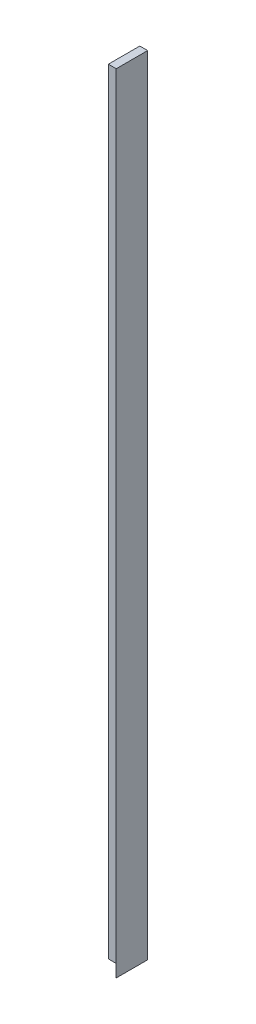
from build123d import *

# Parameters (mm, degrees)
SKETCH1_W           = 25.4
SKETCH1_H           = 635
BOSS_EXTRUDE1_DEPTH = 6.35
SKETCH2_W           = 6.333030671
SKETCH2_H           = 25.4
CUT_EXTRUDE1_DEPTH  = 10.16


with BuildPart() as part:
    # Sketch1 → Boss-Extrude1 (new body)
    with BuildSketch(Plane(origin=(0, 0, 0), x_dir=(0, 0, -1), z_dir=(1, 0, 0))):
        Rectangle(SKETCH1_W, SKETCH1_H)
    extrude(amount=BOSS_EXTRUDE1_DEPTH)

    # Sketch2 → Cut-Extrude1 (cut)
    with BuildSketch(Plane.XZ.offset(317.5)):
        with Locations((3.166515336, 0)):
            Rectangle(SKETCH2_W, SKETCH2_H)
    extrude(amount=-CUT_EXTRUDE1_DEPTH, mode=Mode.SUBTRACT)


solid = part.part
